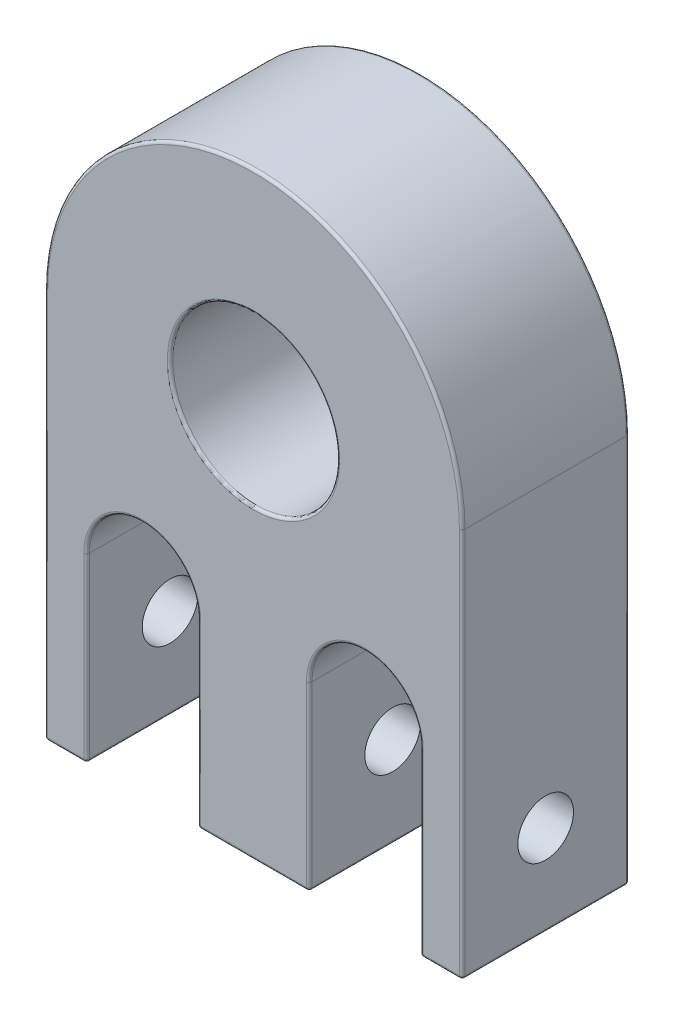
from build123d import *

# Parameters (mm, degrees)
ESQUISSE1_R             = 6
BASE_EXTRUSION_DEPTH    = 12
ESQUISSE2_R             = 2
ENL_V_MAT_EXTRU_1_DEPTH = 54.786615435
CONG_1_R                = 0.2


with BuildPart() as part:
    # Esquisse1 → Base-Extrusion (new body)
    with BuildSketch(Plane.XY):
        with BuildLine():
            Line((0, 0), (0, 28))
            ThreePointArc((0, 28), (15, 43), (30, 28))
            Line((30, 28), (30, 0))
            Line((30, 0), (27, 0))
            Line((27, 0), (27, 13))
            ThreePointArc((27, 13), (23, 17), (19, 13))
            Line((19, 13), (19, 0))
            Line((19, 0), (11, 0))
            Line((11, 0), (11, 13))
            ThreePointArc((11, 13), (7, 17), (3, 13))
            Line((3, 13), (3, 0))
            Line((3, 0), (0, 0))
        make_face()
        with Locations(Location((15, 28, 0), (0, 0, 180))):
            Circle(ESQUISSE1_R, mode=Mode.SUBTRACT)
    extrude(amount=BASE_EXTRUSION_DEPTH)

    # Esquisse2 → Enl_v. mat.-Extru.1 (cut, through all)
    with BuildSketch(Plane(origin=(30, 0, 0), x_dir=(0, 0, -1), z_dir=(1, 0, 0))):
        with Locations((-6, 6.5)):
            Circle(ESQUISSE2_R)
    extrude(amount=-ENL_V_MAT_EXTRU_1_DEPTH, mode=Mode.SUBTRACT)

    # Cong_1
    cong_1_edges = [part.edges().sort_by_distance(p)[0] for p in [
        (0, 0, 6),
        (0, 14, 0),
        (0, 14, 12),
        (3, 0, 6),
        (1.5, 0, 0),
        (1.5, 0, 12),
        (15, 43, 0),
        (30, 14, 0),
        (28.5, 0, 0),
        (27, 6.5, 0),
        (23, 17, 0),
        (19, 6.5, 0),
        (15, 0, 0),
        (11, 6.5, 0),
        (7, 17, 0),
        (3, 6.5, 0),
        (21, 28, 0),
        (15, 43, 12),
        (30, 14, 12),
        (28.5, 0, 12),
        (27, 6.5, 12),
        (23, 17, 12),
        (19, 6.5, 12),
        (15, 0, 12),
        (11, 6.5, 12),
        (7, 17, 12),
        (3, 6.5, 12),
        (21, 28, 12),
        (30, 0, 6),
        (27, 0, 6),
        (19, 0, 6),
        (11, 0, 6),
    ]]
    fillet(cong_1_edges, radius=CONG_1_R)


solid = part.part
